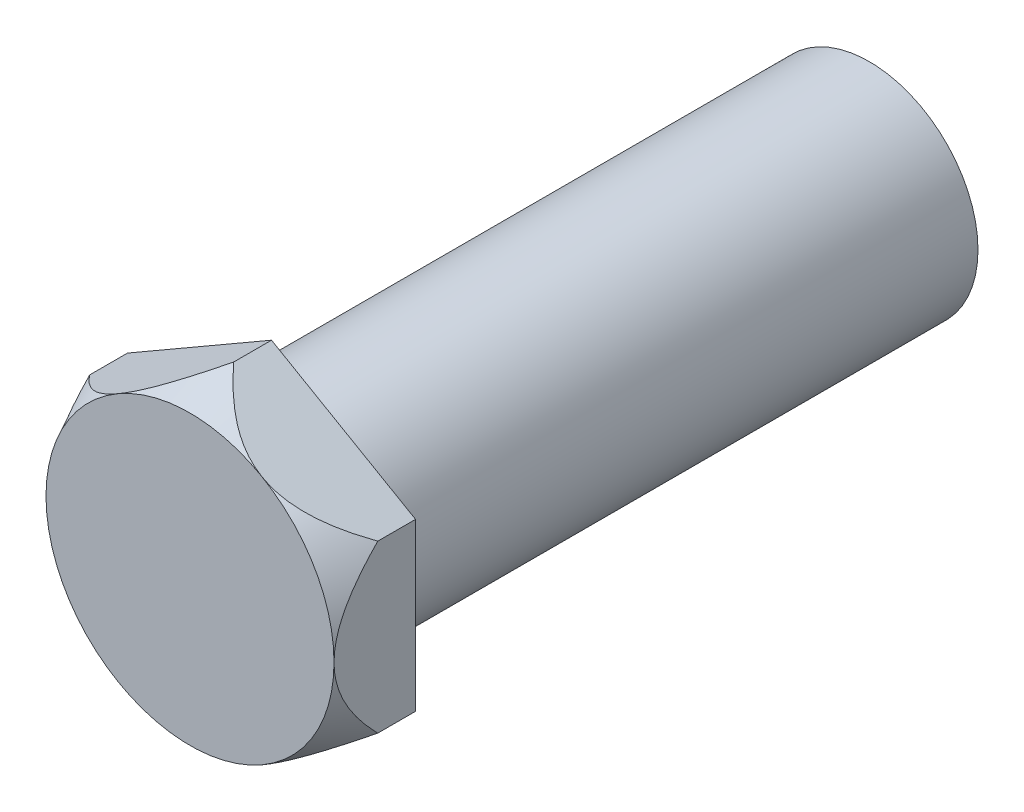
ISO-10303-21;
HEADER;
FILE_DESCRIPTION(('STEP AP214'),'2;1');
FILE_NAME('part.step','',(''),(''),'','','');
FILE_SCHEMA(('AUTOMOTIVE_DESIGN { 1 0 10303 214 1 1 1 1 }'));
ENDSEC;
DATA;
#1=APPLICATION_CONTEXT('core data for automotive mechanical design processes');
#2=APPLICATION_PROTOCOL_DEFINITION('international standard','automotive_design',2000,#1);
#3=PRODUCT_CONTEXT('',#1,'mechanical');
#4=PRODUCT('Part','Part','',(#3));
#5=PRODUCT_RELATED_PRODUCT_CATEGORY('part','',(#4));
#6=PRODUCT_DEFINITION_FORMATION('','',#4);
#7=PRODUCT_DEFINITION_CONTEXT('part definition',#1,'design');
#8=PRODUCT_DEFINITION('design','',#6,#7);
#9=PRODUCT_DEFINITION_SHAPE('','',#8);
#10=(LENGTH_UNIT() NAMED_UNIT(*) SI_UNIT(.MILLI.,.METRE.));
#11=(NAMED_UNIT(*) PLANE_ANGLE_UNIT() SI_UNIT($,.RADIAN.));
#12=(NAMED_UNIT(*) SI_UNIT($,.STERADIAN.) SOLID_ANGLE_UNIT());
#13=UNCERTAINTY_MEASURE_WITH_UNIT(LENGTH_MEASURE(1.E-05),#10,'distance_accuracy_value','');
#14=(GEOMETRIC_REPRESENTATION_CONTEXT(3) GLOBAL_UNCERTAINTY_ASSIGNED_CONTEXT((#13)) GLOBAL_UNIT_ASSIGNED_CONTEXT((#10,
#11,#12)) REPRESENTATION_CONTEXT('',''));
#15=CARTESIAN_POINT('',(0.,0.,0.));
#16=DIRECTION('',(0.,0.,1.));
#17=DIRECTION('',(1.,0.,0.));
#18=AXIS2_PLACEMENT_3D('',#15,#16,#17);
#19=CARTESIAN_POINT('',(0.,3.05995642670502,0.));
#20=DIRECTION('',(0.,0.,1.));
#21=DIRECTION('',(1.,0.,0.));
#22=AXIS2_PLACEMENT_3D('',#19,#20,#21);
#23=PLANE('',#22);
#24=DIRECTION('',(-0.866025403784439,0.5,0.));
#25=VECTOR('',#24,1.);
#26=CARTESIAN_POINT('',(2.65,1.52997821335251,0.));
#27=LINE('',#26,#25);
#28=CARTESIAN_POINT('',(2.65,1.52997821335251,0.));
#29=VERTEX_POINT('',#28);
#30=CARTESIAN_POINT('',(0.,3.05995642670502,0.));
#31=VERTEX_POINT('',#30);
#32=EDGE_CURVE('E113',#29,#31,#27,.T.);
#33=ORIENTED_EDGE('',*,*,#32,.F.);
#34=DIRECTION('',(0.,1.,0.));
#35=VECTOR('',#34,1.);
#36=CARTESIAN_POINT('',(2.65,-1.52997821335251,0.));
#37=LINE('',#36,#35);
#38=CARTESIAN_POINT('',(2.65,-1.52997821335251,0.));
#39=VERTEX_POINT('',#38);
#40=EDGE_CURVE('E260',#39,#29,#37,.T.);
#41=ORIENTED_EDGE('',*,*,#40,.F.);
#42=DIRECTION('',(0.866025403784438,0.5,0.));
#43=VECTOR('',#42,1.);
#44=CARTESIAN_POINT('',(0.,-3.05995642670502,0.));
#45=LINE('',#44,#43);
#46=CARTESIAN_POINT('',(0.,-3.05995642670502,0.));
#47=VERTEX_POINT('',#46);
#48=EDGE_CURVE('E258',#47,#39,#45,.T.);
#49=ORIENTED_EDGE('',*,*,#48,.F.);
#50=DIRECTION('',(0.866025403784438,-0.5,0.));
#51=VECTOR('',#50,1.);
#52=CARTESIAN_POINT('',(-2.65,-1.52997821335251,0.));
#53=LINE('',#52,#51);
#54=CARTESIAN_POINT('',(-2.65,-1.52997821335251,0.));
#55=VERTEX_POINT('',#54);
#56=EDGE_CURVE('E223',#55,#47,#53,.T.);
#57=ORIENTED_EDGE('',*,*,#56,.F.);
#58=DIRECTION('',(0.,-1.,0.));
#59=VECTOR('',#58,1.);
#60=CARTESIAN_POINT('',(-2.65,1.52997821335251,0.));
#61=LINE('',#60,#59);
#62=CARTESIAN_POINT('',(-2.65,1.52997821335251,0.));
#63=VERTEX_POINT('',#62);
#64=EDGE_CURVE('E266',#63,#55,#61,.T.);
#65=ORIENTED_EDGE('',*,*,#64,.F.);
#66=DIRECTION('',(-0.866025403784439,-0.5,0.));
#67=VECTOR('',#66,1.);
#68=CARTESIAN_POINT('',(0.,3.05995642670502,0.));
#69=LINE('',#68,#67);
#70=EDGE_CURVE('E267',#31,#63,#69,.T.);
#71=ORIENTED_EDGE('',*,*,#70,.F.);
#72=EDGE_LOOP('',(#33,#41,#49,#57,#65,#71));
#73=FACE_BOUND('',#72,.T.);
#74=CARTESIAN_POINT('',(0.,0.,0.));
#75=DIRECTION('',(0.,0.,1.));
#76=DIRECTION('',(1.,0.,0.));
#77=AXIS2_PLACEMENT_3D('',#74,#75,#76);
#78=CIRCLE('',#77,2.);
#79=CARTESIAN_POINT('',(2.,0.,0.));
#80=VERTEX_POINT('',#79);
#81=EDGE_CURVE('E12',#80,#80,#78,.F.);
#82=ORIENTED_EDGE('',*,*,#81,.F.);
#83=EDGE_LOOP('',(#82));
#84=FACE_BOUND('',#83,.T.);
#85=ADVANCED_FACE('F31',(#73,#84),#23,.F.);
#86=CARTESIAN_POINT('',(2.65,1.52997821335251,1.5));
#87=DIRECTION('',(-0.5,-0.866025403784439,0.));
#88=DIRECTION('',(0.866025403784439,-0.5,0.));
#89=AXIS2_PLACEMENT_3D('',#86,#87,#88);
#90=PLANE('',#89);
#91=CARTESIAN_POINT('',(2.6502,1.52986274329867,0.695188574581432));
#92=CARTESIAN_POINT('',(2.59634226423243,1.56095752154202,0.756134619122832));
#93=CARTESIAN_POINT('',(2.54130236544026,1.59273482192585,0.815799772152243));
#94=CARTESIAN_POINT('',(2.42795740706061,1.65817456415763,0.931706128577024));
#95=CARTESIAN_POINT('',(2.36963348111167,1.69184789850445,0.987922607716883));
#96=CARTESIAN_POINT('',(2.24764059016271,1.76228052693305,1.09691137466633));
#97=CARTESIAN_POINT('',(2.18386192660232,1.7991031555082,1.14952266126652));
#98=CARTESIAN_POINT('',(2.05217024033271,1.87513538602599,1.24698491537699));
#99=CARTESIAN_POINT('',(1.98426934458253,1.91433798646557,1.29185728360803));
#100=CARTESIAN_POINT('',(1.84748646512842,1.99330961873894,1.36891316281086));
#101=CARTESIAN_POINT('',(1.77883697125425,2.03294442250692,1.40163302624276));
#102=CARTESIAN_POINT('',(1.63838937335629,2.11403188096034,1.45405204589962));
#103=CARTESIAN_POINT('',(1.5666210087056,2.15546736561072,1.47385373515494));
#104=CARTESIAN_POINT('',(1.42019151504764,2.24000847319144,1.49817840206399));
#105=CARTESIAN_POINT('',(1.34550592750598,2.2831282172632,1.50251410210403));
#106=CARTESIAN_POINT('',(1.19674334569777,2.36901633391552,1.49462009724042));
#107=CARTESIAN_POINT('',(1.12266717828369,2.41178422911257,1.48237073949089));
#108=CARTESIAN_POINT('',(0.96618202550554,2.50213097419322,1.44021347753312));
#109=CARTESIAN_POINT('',(0.884289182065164,2.54941182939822,1.40783651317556));
#110=CARTESIAN_POINT('',(0.725557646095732,2.64105552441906,1.32841507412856));
#111=CARTESIAN_POINT('',(0.648760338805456,2.68539447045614,1.28126496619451));
#112=CARTESIAN_POINT('',(0.521460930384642,2.75889081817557,1.19160890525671));
#113=CARTESIAN_POINT('',(0.469637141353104,2.78881129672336,1.15152520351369));
#114=CARTESIAN_POINT('',(0.368447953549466,2.84723290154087,1.0673253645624));
#115=CARTESIAN_POINT('',(0.319084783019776,2.87573274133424,1.02320567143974));
#116=CARTESIAN_POINT('',(0.22368434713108,2.93081220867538,0.932965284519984));
#117=CARTESIAN_POINT('',(0.177596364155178,2.95742111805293,0.886915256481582));
#118=CARTESIAN_POINT('',(0.0873512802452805,3.00952414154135,0.792592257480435));
#119=CARTESIAN_POINT('',(0.0431898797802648,3.03502073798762,0.744324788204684));
#120=CARTESIAN_POINT('',(-0.000199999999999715,3.06007189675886,0.695188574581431));
#121=B_SPLINE_CURVE_WITH_KNOTS('',3,(#91,#92,#93,#94,#95,#96,#97,#98,#99,#100,#101,#102,#103,
#104,#105,#106,#107,#108,#109,#110,#111,#112,#113,#114,#115,#116,#117,#118,#119,#120),
.UNSPECIFIED.,.F.,.F.,(4,2,2,2,2,2,2,2,2,2,2,2,2,2,4),(0.,0.261321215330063,0.524337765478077,
0.795515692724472,1.06593125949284,1.32235701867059,1.57672190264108,1.83415662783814,
2.09189667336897,2.39007583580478,2.69043770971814,2.90633965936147,3.12243369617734,
3.3334879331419,3.54404416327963),.UNSPECIFIED.);
#122=CARTESIAN_POINT('',(2.65,1.52997821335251,0.695415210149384));
#123=VERTEX_POINT('',#122);
#124=CARTESIAN_POINT('',(1.325,2.29496732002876,1.5));
#125=VERTEX_POINT('',#124);
#126=EDGE_CURVE('E106',#123,#125,#121,.T.);
#127=ORIENTED_EDGE('',*,*,#126,.F.);
#128=DIRECTION('',(0.,0.,-1.));
#129=VECTOR('',#128,1.);
#130=CARTESIAN_POINT('',(2.65,1.52997821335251,1.5));
#131=LINE('',#130,#129);
#132=EDGE_CURVE('E55',#123,#29,#131,.T.);
#133=ORIENTED_EDGE('',*,*,#132,.T.);
#134=ORIENTED_EDGE('',*,*,#32,.T.);
#135=DIRECTION('',(0.,0.,-1.));
#136=VECTOR('',#135,1.);
#137=CARTESIAN_POINT('',(0.,3.05995642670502,1.5));
#138=LINE('',#137,#136);
#139=CARTESIAN_POINT('',(0.,3.05995642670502,0.695415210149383));
#140=VERTEX_POINT('',#139);
#141=EDGE_CURVE('E129',#140,#31,#138,.T.);
#142=ORIENTED_EDGE('',*,*,#141,.F.);
#143=EDGE_CURVE('E114',#125,#140,#121,.T.);
#144=ORIENTED_EDGE('',*,*,#143,.F.);
#145=EDGE_LOOP('',(#127,#133,#134,#142,#144));
#146=FACE_BOUND('',#145,.T.);
#147=ADVANCED_FACE('F33',(#146),#90,.F.);
#148=CARTESIAN_POINT('',(0.,3.05995642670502,1.5));
#149=DIRECTION('',(0.5,-0.866025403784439,0.));
#150=DIRECTION('',(0.866025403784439,0.5,0.));
#151=AXIS2_PLACEMENT_3D('',#148,#149,#150);
#152=PLANE('',#151);
#153=CARTESIAN_POINT('',(0.000200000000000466,3.06007189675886,0.695188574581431));
#154=CARTESIAN_POINT('',(-0.0536577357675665,3.02897711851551,0.756134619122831));
#155=CARTESIAN_POINT('',(-0.108697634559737,2.99719981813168,0.815799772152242));
#156=CARTESIAN_POINT('',(-0.222042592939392,2.9317600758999,0.931706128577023));
#157=CARTESIAN_POINT('',(-0.280366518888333,2.89808674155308,0.987922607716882));
#158=CARTESIAN_POINT('',(-0.402359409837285,2.82765411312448,1.09691137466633));
#159=CARTESIAN_POINT('',(-0.466138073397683,2.79083148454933,1.14952266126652));
#160=CARTESIAN_POINT('',(-0.597829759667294,2.71479925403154,1.24698491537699));
#161=CARTESIAN_POINT('',(-0.665730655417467,2.67559665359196,1.29185728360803));
#162=CARTESIAN_POINT('',(-0.802513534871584,2.59662502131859,1.36891316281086));
#163=CARTESIAN_POINT('',(-0.871163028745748,2.55699021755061,1.40163302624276));
#164=CARTESIAN_POINT('',(-1.01161062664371,2.47590275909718,1.45405204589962));
#165=CARTESIAN_POINT('',(-1.0833789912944,2.43446727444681,1.47385373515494));
#166=CARTESIAN_POINT('',(-1.22980848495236,2.34992616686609,1.49817840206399));
#167=CARTESIAN_POINT('',(-1.30449407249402,2.30680642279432,1.50251410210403));
#168=CARTESIAN_POINT('',(-1.45325665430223,2.22091830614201,1.49462009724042));
#169=CARTESIAN_POINT('',(-1.52733282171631,2.17815041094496,1.48237073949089));
#170=CARTESIAN_POINT('',(-1.68381797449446,2.08780366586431,1.44021347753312));
#171=CARTESIAN_POINT('',(-1.76571081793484,2.04052281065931,1.40783651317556));
#172=CARTESIAN_POINT('',(-1.92444235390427,1.94887911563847,1.32841507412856));
#173=CARTESIAN_POINT('',(-2.00123966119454,1.90454016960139,1.28126496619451));
#174=CARTESIAN_POINT('',(-2.12853906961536,1.83104382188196,1.19160890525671));
#175=CARTESIAN_POINT('',(-2.1803628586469,1.80112334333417,1.15152520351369));
#176=CARTESIAN_POINT('',(-2.28155204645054,1.74270173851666,1.0673253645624));
#177=CARTESIAN_POINT('',(-2.33091521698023,1.71420189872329,1.02320567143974));
#178=CARTESIAN_POINT('',(-2.42631565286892,1.65912243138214,0.932965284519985));
#179=CARTESIAN_POINT('',(-2.47240363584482,1.6325135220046,0.886915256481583));
#180=CARTESIAN_POINT('',(-2.56264871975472,1.58041049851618,0.792592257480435));
#181=CARTESIAN_POINT('',(-2.60681012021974,1.55491390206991,0.744324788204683));
#182=CARTESIAN_POINT('',(-2.6502,1.52986274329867,0.695188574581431));
#183=B_SPLINE_CURVE_WITH_KNOTS('',3,(#153,#154,#155,#156,#157,#158,#159,#160,#161,#162,#163,
#164,#165,#166,#167,#168,#169,#170,#171,#172,#173,#174,#175,#176,#177,#178,#179,#180,#181,#182),
.UNSPECIFIED.,.F.,.F.,(4,2,2,2,2,2,2,2,2,2,2,2,2,2,4),(0.,0.261321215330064,0.524337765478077,
0.795515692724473,1.06593125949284,1.3223570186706,1.57672190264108,1.83415662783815,
2.09189667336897,2.39007583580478,2.69043770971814,2.90633965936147,3.12243369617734,
3.33348793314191,3.54404416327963),.UNSPECIFIED.);
#184=CARTESIAN_POINT('',(-1.325,2.29496732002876,1.5));
#185=VERTEX_POINT('',#184);
#186=EDGE_CURVE('E120',#140,#185,#183,.T.);
#187=ORIENTED_EDGE('',*,*,#186,.F.);
#188=ORIENTED_EDGE('',*,*,#141,.T.);
#189=ORIENTED_EDGE('',*,*,#70,.T.);
#190=DIRECTION('',(0.,0.,-1.));
#191=VECTOR('',#190,1.);
#192=CARTESIAN_POINT('',(-2.65,1.52997821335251,1.5));
#193=LINE('',#192,#191);
#194=CARTESIAN_POINT('',(-2.65,1.52997821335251,0.695415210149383));
#195=VERTEX_POINT('',#194);
#196=EDGE_CURVE('E228',#195,#63,#193,.T.);
#197=ORIENTED_EDGE('',*,*,#196,.F.);
#198=EDGE_CURVE('E130',#185,#195,#183,.T.);
#199=ORIENTED_EDGE('',*,*,#198,.F.);
#200=EDGE_LOOP('',(#187,#188,#189,#197,#199));
#201=FACE_BOUND('',#200,.T.);
#202=ADVANCED_FACE('F183',(#201),#152,.F.);
#203=CARTESIAN_POINT('',(-2.65,1.52997821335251,1.5));
#204=DIRECTION('',(1.,0.,0.));
#205=DIRECTION('',(0.,1.,0.));
#206=AXIS2_PLACEMENT_3D('',#203,#204,#205);
#207=PLANE('',#206);
#208=CARTESIAN_POINT('',(-2.65,-3.5626135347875,-2.01331927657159));
#209=CARTESIAN_POINT('',(-2.65,-3.48952785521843,-1.89825176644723));
#210=CARTESIAN_POINT('',(-2.65,-3.41588952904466,-1.78353089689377));
#211=CARTESIAN_POINT('',(-2.65,-3.26724824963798,-1.55494525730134));
#212=CARTESIAN_POINT('',(-2.65,-3.1922450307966,-1.44108066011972));
#213=CARTESIAN_POINT('',(-2.65,-3.03998445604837,-1.21343090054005));
#214=CARTESIAN_POINT('',(-2.65,-2.96271317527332,-1.0996550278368));
#215=CARTESIAN_POINT('',(-2.65,-2.80621453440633,-0.873471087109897));
#216=CARTESIAN_POINT('',(-2.65,-2.72698737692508,-0.761062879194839));
#217=CARTESIAN_POINT('',(-2.65,-2.55597473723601,-0.523885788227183));
#218=CARTESIAN_POINT('',(-2.65,-2.4638667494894,-0.3993484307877));
#219=CARTESIAN_POINT('',(-2.65,-2.27576187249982,-0.153249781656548));
#220=CARTESIAN_POINT('',(-2.65,-2.17976547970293,-0.0316881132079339));
#221=CARTESIAN_POINT('',(-2.65,-1.98303182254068,0.206798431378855));
#222=CARTESIAN_POINT('',(-2.65,-1.88231364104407,0.323738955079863));
#223=CARTESIAN_POINT('',(-2.65,-1.67414252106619,0.551416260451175));
#224=CARTESIAN_POINT('',(-2.65,-1.56669544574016,0.662158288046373));
#225=CARTESIAN_POINT('',(-2.65,-1.3900948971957,0.828907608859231));
#226=CARTESIAN_POINT('',(-2.65,-1.32405047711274,0.888192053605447));
#227=CARTESIAN_POINT('',(-2.65,-1.18817649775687,1.00242114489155));
#228=CARTESIAN_POINT('',(-2.65,-1.11834399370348,1.05736233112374));
#229=CARTESIAN_POINT('',(-2.65,-0.975484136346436,1.16032855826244));
#230=CARTESIAN_POINT('',(-2.65,-0.902530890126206,1.20845494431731));
#231=CARTESIAN_POINT('',(-2.65,-0.751906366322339,1.29653266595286));
#232=CARTESIAN_POINT('',(-2.65,-0.674243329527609,1.33649777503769));
#233=CARTESIAN_POINT('',(-2.65,-0.517572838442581,1.40375331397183));
#234=CARTESIAN_POINT('',(-2.65,-0.438779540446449,1.43152921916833));
#235=CARTESIAN_POINT('',(-2.65,-0.27766742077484,1.47386323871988));
#236=CARTESIAN_POINT('',(-2.65,-0.195351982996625,1.4884337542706));
#237=CARTESIAN_POINT('',(-2.65,-0.0288866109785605,1.5022604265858));
#238=CARTESIAN_POINT('',(-2.65,0.0552713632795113,1.50142423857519));
#239=CARTESIAN_POINT('',(-2.65,0.222003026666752,1.48435081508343));
#240=CARTESIAN_POINT('',(-2.65,0.304575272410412,1.4681001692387));
#241=CARTESIAN_POINT('',(-2.65,0.487379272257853,1.41649928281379));
#242=CARTESIAN_POINT('',(-2.65,0.586471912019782,1.37722074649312));
#243=CARTESIAN_POINT('',(-2.65,0.777442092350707,1.28386946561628));
#244=CARTESIAN_POINT('',(-2.65,0.869295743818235,1.22975017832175));
#245=CARTESIAN_POINT('',(-2.65,1.07102812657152,1.09518673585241));
#246=CARTESIAN_POINT('',(-2.65,1.1787738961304,1.01161204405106));
#247=CARTESIAN_POINT('',(-2.65,1.38589297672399,0.834544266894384));
#248=CARTESIAN_POINT('',(-2.65,1.48524793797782,0.741030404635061));
#249=CARTESIAN_POINT('',(-2.65,1.6787754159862,0.546387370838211));
#250=CARTESIAN_POINT('',(-2.65,1.77286249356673,0.445174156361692));
#251=CARTESIAN_POINT('',(-2.65,1.91015995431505,0.29010943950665));
#252=CARTESIAN_POINT('',(-2.65,1.95526522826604,0.237907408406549));
#253=CARTESIAN_POINT('',(-2.65,2.04436879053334,0.132568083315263));
#254=CARTESIAN_POINT('',(-2.65,2.08836711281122,0.0794308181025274));
#255=CARTESIAN_POINT('',(-2.65,2.22685401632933,-0.0909298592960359));
#256=CARTESIAN_POINT('',(-2.65,2.31952346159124,-0.209632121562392));
#257=CARTESIAN_POINT('',(-2.65,2.50132385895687,-0.449724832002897));
#258=CARTESIAN_POINT('',(-2.65,2.59045421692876,-0.571115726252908));
#259=CARTESIAN_POINT('',(-2.65,2.76596034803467,-0.815963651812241));
#260=CARTESIAN_POINT('',(-2.65,2.852334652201,-0.939421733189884));
#261=CARTESIAN_POINT('',(-2.65,3.02283031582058,-1.18788669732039));
#262=CARTESIAN_POINT('',(-2.65,3.10695157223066,-1.31289365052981));
#263=CARTESIAN_POINT('',(-2.65,3.35705231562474,-1.69044236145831));
#264=CARTESIAN_POINT('',(-2.65,3.52027365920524,-1.94480978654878));
#265=CARTESIAN_POINT('',(-2.65,3.84158994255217,-2.45662656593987));
#266=CARTESIAN_POINT('',(-2.65,3.99968645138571,-2.71407494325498));
#267=CARTESIAN_POINT('',(-2.65,4.2948081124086,-3.20245345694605));
#268=CARTESIAN_POINT('',(-2.65,4.43222167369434,-3.43314941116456));
#269=CARTESIAN_POINT('',(-2.65,4.70479573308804,-3.89589484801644));
#270=CARTESIAN_POINT('',(-2.65,4.83995602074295,-4.12794445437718));
#271=CARTESIAN_POINT('',(-2.65,5.10773302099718,-4.5917672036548));
#272=CARTESIAN_POINT('',(-2.65,5.24035976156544,-4.82353456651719));
#273=CARTESIAN_POINT('',(-2.65,5.50415166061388,-5.28786064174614));
#274=CARTESIAN_POINT('',(-2.65,5.63531700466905,-5.52041924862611));
#275=CARTESIAN_POINT('',(-2.65,5.76592217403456,-5.75328923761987));
#276=B_SPLINE_CURVE_WITH_KNOTS('',3,(#208,#209,#210,#211,#212,#213,#214,#215,#216,#217,#218,
#219,#220,#221,#222,#223,#224,#225,#226,#227,#228,#229,#230,#231,#232,#233,#234,#235,#236,#237,
#238,#239,#240,#241,#242,#243,#244,#245,#246,#247,#248,#249,#250,#251,#252,#253,#254,#255,#256,
#257,#258,#259,#260,#261,#262,#263,#264,#265,#266,#267,#268,#269,#270,#271,#272,#273,#274,#275),
.UNSPECIFIED.,.F.,.F.,(4,2,2,2,2,2,2,2,2,2,2,2,2,2,2,2,2,2,2,2,2,2,2,2,2,2,2,2,2,2,2,2,2,4),(0.,
0.408951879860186,0.817984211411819,1.23057119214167,1.64311561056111,2.10775352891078,
2.57233231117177,3.0351727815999,3.49761542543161,3.76372760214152,4.03004969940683,
4.29186284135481,4.55323041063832,4.80295011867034,5.05243507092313,5.30341587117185,
5.55461522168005,5.87257677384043,6.19154713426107,6.59962509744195,7.008573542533,
7.42290539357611,7.62986359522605,7.83681543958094,8.2884906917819,8.74024145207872,
9.19222910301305,9.64423739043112,10.5508303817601,11.457143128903,12.2626872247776,
13.0683061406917,13.869395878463,14.6703827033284),.UNSPECIFIED.);
#277=CARTESIAN_POINT('',(-2.65,0.,1.5));
#278=VERTEX_POINT('',#277);
#279=EDGE_CURVE('E177',#195,#278,#276,.F.);
#280=ORIENTED_EDGE('',*,*,#279,.F.);
#281=ORIENTED_EDGE('',*,*,#196,.T.);
#282=ORIENTED_EDGE('',*,*,#64,.T.);
#283=DIRECTION('',(0.,0.,-1.));
#284=VECTOR('',#283,1.);
#285=CARTESIAN_POINT('',(-2.65,-1.52997821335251,1.5));
#286=LINE('',#285,#284);
#287=CARTESIAN_POINT('',(-2.65,-1.52997821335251,0.695415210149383));
#288=VERTEX_POINT('',#287);
#289=EDGE_CURVE('E225',#288,#55,#286,.T.);
#290=ORIENTED_EDGE('',*,*,#289,.F.);
#291=EDGE_CURVE('E172',#278,#288,#276,.F.);
#292=ORIENTED_EDGE('',*,*,#291,.F.);
#293=EDGE_LOOP('',(#280,#281,#282,#290,#292));
#294=FACE_BOUND('',#293,.T.);
#295=ADVANCED_FACE('F179',(#294),#207,.F.);
#296=CARTESIAN_POINT('',(-2.65,-1.52997821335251,1.5));
#297=DIRECTION('',(0.5,0.866025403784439,0.));
#298=DIRECTION('',(-0.866025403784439,0.5,0.));
#299=AXIS2_PLACEMENT_3D('',#296,#297,#298);
#300=PLANE('',#299);
#301=CARTESIAN_POINT('',(-2.6502,-1.52986274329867,0.695188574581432));
#302=CARTESIAN_POINT('',(-2.59634226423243,-1.56095752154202,0.756134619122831));
#303=CARTESIAN_POINT('',(-2.54130236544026,-1.59273482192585,0.815799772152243));
#304=CARTESIAN_POINT('',(-2.42795740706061,-1.65817456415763,0.931706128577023));
#305=CARTESIAN_POINT('',(-2.36963348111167,-1.69184789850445,0.987922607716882));
#306=CARTESIAN_POINT('',(-2.24764059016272,-1.76228052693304,1.09691137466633));
#307=CARTESIAN_POINT('',(-2.18386192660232,-1.79910315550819,1.14952266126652));
#308=CARTESIAN_POINT('',(-2.05217024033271,-1.87513538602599,1.24698491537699));
#309=CARTESIAN_POINT('',(-1.98426934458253,-1.91433798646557,1.29185728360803));
#310=CARTESIAN_POINT('',(-1.84748646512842,-1.99330961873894,1.36891316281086));
#311=CARTESIAN_POINT('',(-1.77883697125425,-2.03294442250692,1.40163302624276));
#312=CARTESIAN_POINT('',(-1.63838937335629,-2.11403188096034,1.45405204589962));
#313=CARTESIAN_POINT('',(-1.5666210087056,-2.15546736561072,1.47385373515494));
#314=CARTESIAN_POINT('',(-1.42019151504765,-2.24000847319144,1.49817840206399));
#315=CARTESIAN_POINT('',(-1.34550592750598,-2.2831282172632,1.50251410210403));
#316=CARTESIAN_POINT('',(-1.19674334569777,-2.36901633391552,1.49462009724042));
#317=CARTESIAN_POINT('',(-1.12266717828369,-2.41178422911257,1.48237073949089));
#318=CARTESIAN_POINT('',(-0.96618202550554,-2.50213097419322,1.44021347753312));
#319=CARTESIAN_POINT('',(-0.884289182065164,-2.54941182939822,1.40783651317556));
#320=CARTESIAN_POINT('',(-0.725557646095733,-2.64105552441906,1.32841507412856));
#321=CARTESIAN_POINT('',(-0.648760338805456,-2.68539447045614,1.28126496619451));
#322=CARTESIAN_POINT('',(-0.521460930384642,-2.75889081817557,1.19160890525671));
#323=CARTESIAN_POINT('',(-0.469637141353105,-2.78881129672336,1.15152520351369));
#324=CARTESIAN_POINT('',(-0.368447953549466,-2.84723290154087,1.0673253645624));
#325=CARTESIAN_POINT('',(-0.319084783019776,-2.87573274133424,1.02320567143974));
#326=CARTESIAN_POINT('',(-0.223684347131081,-2.93081220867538,0.932965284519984));
#327=CARTESIAN_POINT('',(-0.177596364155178,-2.95742111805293,0.886915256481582));
#328=CARTESIAN_POINT('',(-0.0873512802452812,-3.00952414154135,0.792592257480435));
#329=CARTESIAN_POINT('',(-0.0431898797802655,-3.03502073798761,0.744324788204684));
#330=CARTESIAN_POINT('',(0.000199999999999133,-3.06007189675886,0.695188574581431));
#331=B_SPLINE_CURVE_WITH_KNOTS('',3,(#301,#302,#303,#304,#305,#306,#307,#308,#309,#310,#311,
#312,#313,#314,#315,#316,#317,#318,#319,#320,#321,#322,#323,#324,#325,#326,#327,#328,#329,#330),
.UNSPECIFIED.,.F.,.F.,(4,2,2,2,2,2,2,2,2,2,2,2,2,2,4),(0.,0.261321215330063,0.524337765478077,
0.795515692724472,1.06593125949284,1.3223570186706,1.57672190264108,1.83415662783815,
2.09189667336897,2.39007583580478,2.69043770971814,2.90633965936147,3.12243369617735,
3.33348793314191,3.54404416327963),.UNSPECIFIED.);
#332=CARTESIAN_POINT('',(-1.325,-2.29496732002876,1.5));
#333=VERTEX_POINT('',#332);
#334=EDGE_CURVE('E178',#288,#333,#331,.T.);
#335=ORIENTED_EDGE('',*,*,#334,.F.);
#336=ORIENTED_EDGE('',*,*,#289,.T.);
#337=ORIENTED_EDGE('',*,*,#56,.T.);
#338=DIRECTION('',(0.,0.,-1.));
#339=VECTOR('',#338,1.);
#340=CARTESIAN_POINT('',(0.,-3.05995642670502,1.5));
#341=LINE('',#340,#339);
#342=CARTESIAN_POINT('',(0.,-3.05995642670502,0.695415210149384));
#343=VERTEX_POINT('',#342);
#344=EDGE_CURVE('E215',#343,#47,#341,.T.);
#345=ORIENTED_EDGE('',*,*,#344,.F.);
#346=EDGE_CURVE('E167',#333,#343,#331,.T.);
#347=ORIENTED_EDGE('',*,*,#346,.F.);
#348=EDGE_LOOP('',(#335,#336,#337,#345,#347));
#349=FACE_BOUND('',#348,.T.);
#350=ADVANCED_FACE('F182',(#349),#300,.F.);
#351=CARTESIAN_POINT('',(0.,-3.05995642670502,1.5));
#352=DIRECTION('',(-0.5,0.866025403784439,0.));
#353=DIRECTION('',(-0.866025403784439,-0.5,0.));
#354=AXIS2_PLACEMENT_3D('',#351,#352,#353);
#355=PLANE('',#354);
#356=CARTESIAN_POINT('',(-0.000200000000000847,-3.06007189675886,0.695188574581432));
#357=CARTESIAN_POINT('',(0.0536577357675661,-3.02897711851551,0.756134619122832));
#358=CARTESIAN_POINT('',(0.108697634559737,-2.99719981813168,0.815799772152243));
#359=CARTESIAN_POINT('',(0.222042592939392,-2.9317600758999,0.931706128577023));
#360=CARTESIAN_POINT('',(0.280366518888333,-2.89808674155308,0.987922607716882));
#361=CARTESIAN_POINT('',(0.402359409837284,-2.82765411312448,1.09691137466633));
#362=CARTESIAN_POINT('',(0.466138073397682,-2.79083148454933,1.14952266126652));
#363=CARTESIAN_POINT('',(0.597829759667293,-2.71479925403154,1.24698491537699));
#364=CARTESIAN_POINT('',(0.665730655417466,-2.67559665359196,1.29185728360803));
#365=CARTESIAN_POINT('',(0.802513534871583,-2.59662502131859,1.36891316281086));
#366=CARTESIAN_POINT('',(0.871163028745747,-2.55699021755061,1.40163302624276));
#367=CARTESIAN_POINT('',(1.01161062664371,-2.47590275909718,1.45405204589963));
#368=CARTESIAN_POINT('',(1.0833789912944,-2.43446727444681,1.47385373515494));
#369=CARTESIAN_POINT('',(1.22980848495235,-2.34992616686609,1.49817840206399));
#370=CARTESIAN_POINT('',(1.30449407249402,-2.30680642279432,1.50251410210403));
#371=CARTESIAN_POINT('',(1.45325665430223,-2.22091830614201,1.49462009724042));
#372=CARTESIAN_POINT('',(1.52733282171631,-2.17815041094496,1.48237073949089));
#373=CARTESIAN_POINT('',(1.68381797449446,-2.08780366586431,1.44021347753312));
#374=CARTESIAN_POINT('',(1.76571081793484,-2.0405228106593,1.40783651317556));
#375=CARTESIAN_POINT('',(1.92444235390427,-1.94887911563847,1.32841507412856));
#376=CARTESIAN_POINT('',(2.00123966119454,-1.90454016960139,1.28126496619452));
#377=CARTESIAN_POINT('',(2.12853906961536,-1.83104382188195,1.19160890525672));
#378=CARTESIAN_POINT('',(2.1803628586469,-1.80112334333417,1.15152520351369));
#379=CARTESIAN_POINT('',(2.28155204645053,-1.74270173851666,1.06732536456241));
#380=CARTESIAN_POINT('',(2.33091521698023,-1.71420189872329,1.02320567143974));
#381=CARTESIAN_POINT('',(2.42631565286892,-1.65912243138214,0.932965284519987));
#382=CARTESIAN_POINT('',(2.47240363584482,-1.6325135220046,0.886915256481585));
#383=CARTESIAN_POINT('',(2.56264871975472,-1.58041049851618,0.792592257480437));
#384=CARTESIAN_POINT('',(2.60681012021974,-1.55491390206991,0.744324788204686));
#385=CARTESIAN_POINT('',(2.6502,-1.52986274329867,0.695188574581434));
#386=B_SPLINE_CURVE_WITH_KNOTS('',3,(#356,#357,#358,#359,#360,#361,#362,#363,#364,#365,#366,
#367,#368,#369,#370,#371,#372,#373,#374,#375,#376,#377,#378,#379,#380,#381,#382,#383,#384,#385),
.UNSPECIFIED.,.F.,.F.,(4,2,2,2,2,2,2,2,2,2,2,2,2,2,4),(0.,0.261321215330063,0.524337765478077,
0.795515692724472,1.06593125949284,1.3223570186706,1.57672190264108,1.83415662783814,
2.09189667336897,2.39007583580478,2.69043770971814,2.90633965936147,3.12243369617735,
3.33348793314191,3.54404416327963),.UNSPECIFIED.);
#387=CARTESIAN_POINT('',(1.325,-2.29496732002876,1.5));
#388=VERTEX_POINT('',#387);
#389=EDGE_CURVE('E212',#343,#388,#386,.T.);
#390=ORIENTED_EDGE('',*,*,#389,.F.);
#391=ORIENTED_EDGE('',*,*,#344,.T.);
#392=ORIENTED_EDGE('',*,*,#48,.T.);
#393=DIRECTION('',(0.,0.,-1.));
#394=VECTOR('',#393,1.);
#395=CARTESIAN_POINT('',(2.65,-1.52997821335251,1.5));
#396=LINE('',#395,#394);
#397=CARTESIAN_POINT('',(2.65,-1.52997821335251,0.695415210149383));
#398=VERTEX_POINT('',#397);
#399=EDGE_CURVE('E226',#398,#39,#396,.T.);
#400=ORIENTED_EDGE('',*,*,#399,.F.);
#401=EDGE_CURVE('E161',#388,#398,#386,.T.);
#402=ORIENTED_EDGE('',*,*,#401,.F.);
#403=EDGE_LOOP('',(#390,#391,#392,#400,#402));
#404=FACE_BOUND('',#403,.T.);
#405=ADVANCED_FACE('F201',(#404),#355,.F.);
#406=CARTESIAN_POINT('',(2.65,-1.52997821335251,1.5));
#407=DIRECTION('',(-1.,0.,0.));
#408=DIRECTION('',(0.,0.,1.));
#409=AXIS2_PLACEMENT_3D('',#406,#407,#408);
#410=PLANE('',#409);
#411=CARTESIAN_POINT('',(2.65,-3.56261335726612,-2.0133189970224));
#412=CARTESIAN_POINT('',(2.65,-3.48952768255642,-1.89825149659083));
#413=CARTESIAN_POINT('',(2.65,-3.41588936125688,-1.78353063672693));
#414=CARTESIAN_POINT('',(2.65,-3.2672480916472,-1.55494501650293));
#415=CARTESIAN_POINT('',(2.65,-3.1922448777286,-1.44108042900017));
#416=CARTESIAN_POINT('',(2.65,-3.03998431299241,-1.21343068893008));
#417=CARTESIAN_POINT('',(2.65,-2.96271303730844,-1.09965482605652));
#418=CARTESIAN_POINT('',(2.65,-2.80621440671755,-0.873470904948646));
#419=CARTESIAN_POINT('',(2.65,-2.72698725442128,-0.761062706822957));
#420=CARTESIAN_POINT('',(2.65,-2.55597462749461,-0.523885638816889));
#421=CARTESIAN_POINT('',(2.65,-2.46386664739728,-0.399348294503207));
#422=CARTESIAN_POINT('',(2.65,-2.27576178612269,-0.153249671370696));
#423=CARTESIAN_POINT('',(2.65,-2.17976540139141,-0.0316880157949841));
#424=CARTESIAN_POINT('',(2.65,-1.98303176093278,0.206798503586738));
#425=CARTESIAN_POINT('',(2.65,-1.88231358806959,0.323739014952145));
#426=CARTESIAN_POINT('',(2.65,-1.67414248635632,0.551416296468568));
#427=CARTESIAN_POINT('',(2.65,-1.56669542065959,0.662158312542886));
#428=CARTESIAN_POINT('',(2.65,-1.39009488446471,0.828907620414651));
#429=CARTESIAN_POINT('',(2.65,-1.3240504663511,0.888192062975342));
#430=CARTESIAN_POINT('',(2.65,-1.18817649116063,1.00242115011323));
#431=CARTESIAN_POINT('',(2.65,-1.11834398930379,1.05736233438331));
#432=CARTESIAN_POINT('',(2.65,-0.975484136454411,1.16032855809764));
#433=CARTESIAN_POINT('',(2.65,-0.902530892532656,1.20845494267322));
#434=CARTESIAN_POINT('',(2.65,-0.751906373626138,1.29653266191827));
#435=CARTESIAN_POINT('',(2.65,-0.674243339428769,1.33649777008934));
#436=CARTESIAN_POINT('',(2.65,-0.517572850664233,1.40375330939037));
#437=CARTESIAN_POINT('',(2.65,-0.438779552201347,1.43152921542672));
#438=CARTESIAN_POINT('',(2.65,-0.277667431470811,1.4738632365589));
#439=CARTESIAN_POINT('',(2.65,-0.195351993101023,1.48843375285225));
#440=CARTESIAN_POINT('',(2.65,-0.0288866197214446,1.50226042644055));
#441=CARTESIAN_POINT('',(2.65,0.0552713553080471,1.50142423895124));
#442=CARTESIAN_POINT('',(2.65,0.222003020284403,1.48435081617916));
#443=CARTESIAN_POINT('',(2.65,0.304575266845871,1.46810017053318));
#444=CARTESIAN_POINT('',(2.65,0.487379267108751,1.4164992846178));
#445=CARTESIAN_POINT('',(2.65,0.58647190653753,1.37722074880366));
#446=CARTESIAN_POINT('',(2.65,0.777442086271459,1.28386946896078));
#447=CARTESIAN_POINT('',(2.65,0.869295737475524,1.22975018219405));
#448=CARTESIAN_POINT('',(2.65,1.07102811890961,1.09518674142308));
#449=CARTESIAN_POINT('',(2.65,1.17877388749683,1.0116120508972));
#450=CARTESIAN_POINT('',(2.65,1.3858929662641,0.834544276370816));
#451=CARTESIAN_POINT('',(2.65,1.48524792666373,0.741030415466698));
#452=CARTESIAN_POINT('',(2.65,1.67877540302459,0.546387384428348));
#453=CARTESIAN_POINT('',(2.65,1.77286247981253,0.445174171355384));
#454=CARTESIAN_POINT('',(2.65,1.91015993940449,0.290109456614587));
#455=CARTESIAN_POINT('',(2.65,1.95526521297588,0.237907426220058));
#456=CARTESIAN_POINT('',(2.65,2.0443687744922,0.132568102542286));
#457=CARTESIAN_POINT('',(2.65,2.08836709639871,0.0794308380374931));
#458=CARTESIAN_POINT('',(2.65,2.22685399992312,-0.0909298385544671));
#459=CARTESIAN_POINT('',(2.65,2.31952344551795,-0.209632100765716));
#460=CARTESIAN_POINT('',(2.65,2.50132384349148,-0.449724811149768));
#461=CARTESIAN_POINT('',(2.65,2.59045420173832,-0.571115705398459));
#462=CARTESIAN_POINT('',(2.65,2.76596033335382,-0.815963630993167));
#463=CARTESIAN_POINT('',(2.65,2.8523346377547,-0.93942171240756));
#464=CARTESIAN_POINT('',(2.65,3.02283030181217,-1.18788667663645));
#465=CARTESIAN_POINT('',(2.65,3.10695155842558,-1.3128936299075));
#466=CARTESIAN_POINT('',(2.65,3.35705230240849,-1.69044234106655));
#467=CARTESIAN_POINT('',(2.65,3.52027364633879,-1.94480976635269));
#468=CARTESIAN_POINT('',(2.65,3.84158993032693,-2.4566265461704));
#469=CARTESIAN_POINT('',(2.65,3.99968643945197,-2.71407492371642));
#470=CARTESIAN_POINT('',(2.65,4.294808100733,-3.20245343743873));
#471=CARTESIAN_POINT('',(2.65,4.43222166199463,-3.43314939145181));
#472=CARTESIAN_POINT('',(2.65,4.70479572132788,-3.89589482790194));
#473=CARTESIAN_POINT('',(2.65,4.83995600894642,-4.12794443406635));
#474=CARTESIAN_POINT('',(2.65,5.10773300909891,-4.59176718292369));
#475=CARTESIAN_POINT('',(2.65,5.2403597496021,-4.82353454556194));
#476=CARTESIAN_POINT('',(2.65,5.50415164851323,-5.28786062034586));
#477=CARTESIAN_POINT('',(2.65,5.63531699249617,-5.52041922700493));
#478=CARTESIAN_POINT('',(2.65,5.76592216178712,-5.75328921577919));
#479=B_SPLINE_CURVE_WITH_KNOTS('',3,(#411,#412,#413,#414,#415,#416,#417,#418,#419,#420,#421,
#422,#423,#424,#425,#426,#427,#428,#429,#430,#431,#432,#433,#434,#435,#436,#437,#438,#439,#440,
#441,#442,#443,#444,#445,#446,#447,#448,#449,#450,#451,#452,#453,#454,#455,#456,#457,#458,#459,
#460,#461,#462,#463,#464,#465,#466,#467,#468,#469,#470,#471,#472,#473,#474,#475,#476,#477,#478),
.UNSPECIFIED.,.F.,.F.,(4,2,2,2,2,2,2,2,2,2,2,2,2,2,2,2,2,2,2,2,2,2,2,2,2,2,2,2,2,2,2,2,2,4),(0.,
0.408951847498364,0.817984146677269,1.23057109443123,1.64311547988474,2.10775335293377,
2.57233208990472,3.03517251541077,3.49761511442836,3.76372728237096,4.03004937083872,
4.29186250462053,4.55323006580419,4.80294977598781,5.05243473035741,5.30341553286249,
5.55461488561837,5.87257643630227,6.19154679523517,6.59962475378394,7.00857319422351,
7.42290504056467,7.62986323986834,7.83681508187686,8.28849033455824,8.74024109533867,
9.19222874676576,9.6442370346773,10.5508300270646,11.4571427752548,12.2626868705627,
13.0683057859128,13.8693955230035,14.6703823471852),.UNSPECIFIED.);
#480=CARTESIAN_POINT('',(2.65,0.,1.5));
#481=VERTEX_POINT('',#480);
#482=EDGE_CURVE('E257',#398,#481,#479,.T.);
#483=ORIENTED_EDGE('',*,*,#482,.F.);
#484=ORIENTED_EDGE('',*,*,#399,.T.);
#485=ORIENTED_EDGE('',*,*,#40,.T.);
#486=ORIENTED_EDGE('',*,*,#132,.F.);
#487=EDGE_CURVE('E111',#481,#123,#479,.T.);
#488=ORIENTED_EDGE('',*,*,#487,.F.);
#489=EDGE_LOOP('',(#483,#484,#485,#486,#488));
#490=FACE_BOUND('',#489,.T.);
#491=ADVANCED_FACE('F198',(#490),#410,.F.);
#492=CARTESIAN_POINT('',(0.,0.,1.5));
#493=DIRECTION('',(0.,0.,-1.));
#494=DIRECTION('',(1.,0.,0.));
#495=AXIS2_PLACEMENT_3D('',#492,#493,#494);
#496=CONICAL_SURFACE('',#495,2.65,0.471238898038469);
#497=ORIENTED_EDGE('',*,*,#401,.T.);
#498=ORIENTED_EDGE('',*,*,#482,.T.);
#499=CARTESIAN_POINT('',(0.,0.,1.5));
#500=DIRECTION('',(0.,0.,1.));
#501=DIRECTION('',(1.,0.,0.));
#502=AXIS2_PLACEMENT_3D('',#499,#500,#501);
#503=CIRCLE('',#502,2.65);
#504=EDGE_CURVE('E47',#388,#481,#503,.T.);
#505=ORIENTED_EDGE('',*,*,#504,.F.);
#506=EDGE_LOOP('',(#497,#498,#505));
#507=FACE_BOUND('',#506,.T.);
#508=ADVANCED_FACE('F146',(#507),#496,.T.);
#509=ORIENTED_EDGE('',*,*,#346,.T.);
#510=ORIENTED_EDGE('',*,*,#389,.T.);
#511=EDGE_CURVE('E234',#333,#388,#503,.T.);
#512=ORIENTED_EDGE('',*,*,#511,.F.);
#513=EDGE_LOOP('',(#509,#510,#512));
#514=FACE_BOUND('',#513,.T.);
#515=ADVANCED_FACE('F246',(#514),#496,.T.);
#516=ORIENTED_EDGE('',*,*,#291,.T.);
#517=ORIENTED_EDGE('',*,*,#334,.T.);
#518=EDGE_CURVE('E235',#278,#333,#503,.T.);
#519=ORIENTED_EDGE('',*,*,#518,.F.);
#520=EDGE_LOOP('',(#516,#517,#519));
#521=FACE_BOUND('',#520,.T.);
#522=ADVANCED_FACE('F245',(#521),#496,.T.);
#523=ORIENTED_EDGE('',*,*,#198,.T.);
#524=ORIENTED_EDGE('',*,*,#279,.T.);
#525=EDGE_CURVE('E124',#185,#278,#503,.T.);
#526=ORIENTED_EDGE('',*,*,#525,.F.);
#527=EDGE_LOOP('',(#523,#524,#526));
#528=FACE_BOUND('',#527,.T.);
#529=ADVANCED_FACE('F252',(#528),#496,.T.);
#530=ORIENTED_EDGE('',*,*,#143,.T.);
#531=ORIENTED_EDGE('',*,*,#186,.T.);
#532=EDGE_CURVE('E40',#125,#185,#503,.T.);
#533=ORIENTED_EDGE('',*,*,#532,.F.);
#534=EDGE_LOOP('',(#530,#531,#533));
#535=FACE_BOUND('',#534,.T.);
#536=ADVANCED_FACE('F118',(#535),#496,.T.);
#537=ORIENTED_EDGE('',*,*,#126,.T.);
#538=CARTESIAN_POINT('',(0.,0.,1.5));
#539=DIRECTION('',(0.,0.,1.));
#540=DIRECTION('',(1.,0.,0.));
#541=AXIS2_PLACEMENT_3D('',#538,#539,#540);
#542=CIRCLE('',#541,2.65);
#543=EDGE_CURVE('E109',#481,#125,#542,.T.);
#544=ORIENTED_EDGE('',*,*,#543,.F.);
#545=ORIENTED_EDGE('',*,*,#487,.T.);
#546=EDGE_LOOP('',(#537,#544,#545));
#547=FACE_BOUND('',#546,.T.);
#548=ADVANCED_FACE('F108',(#547),#496,.T.);
#549=CARTESIAN_POINT('',(0.,3.05995642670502,1.5));
#550=DIRECTION('',(0.,0.,1.));
#551=DIRECTION('',(1.,0.,0.));
#552=AXIS2_PLACEMENT_3D('',#549,#550,#551);
#553=PLANE('',#552);
#554=ORIENTED_EDGE('',*,*,#504,.T.);
#555=ORIENTED_EDGE('',*,*,#543,.T.);
#556=ORIENTED_EDGE('',*,*,#532,.T.);
#557=ORIENTED_EDGE('',*,*,#525,.T.);
#558=ORIENTED_EDGE('',*,*,#518,.T.);
#559=ORIENTED_EDGE('',*,*,#511,.T.);
#560=EDGE_LOOP('',(#554,#555,#556,#557,#558,#559));
#561=FACE_BOUND('',#560,.T.);
#562=ADVANCED_FACE('F125',(#561),#553,.T.);
#563=CARTESIAN_POINT('',(0.,0.,-11.));
#564=DIRECTION('',(0.,0.,1.));
#565=DIRECTION('',(1.,0.,0.));
#566=AXIS2_PLACEMENT_3D('',#563,#564,#565);
#567=CYLINDRICAL_SURFACE('',#566,2.);
#568=CARTESIAN_POINT('',(0.,0.,-11.));
#569=DIRECTION('',(0.,0.,-1.));
#570=DIRECTION('',(-1.,0.,0.));
#571=AXIS2_PLACEMENT_3D('',#568,#569,#570);
#572=CIRCLE('',#571,2.);
#573=CARTESIAN_POINT('',(-2.,0.,-11.));
#574=VERTEX_POINT('',#573);
#575=EDGE_CURVE('E126',#574,#574,#572,.T.);
#576=ORIENTED_EDGE('',*,*,#575,.F.);
#577=EDGE_LOOP('',(#576));
#578=FACE_BOUND('',#577,.T.);
#579=ORIENTED_EDGE('',*,*,#81,.T.);
#580=EDGE_LOOP('',(#579));
#581=FACE_BOUND('',#580,.T.);
#582=ADVANCED_FACE('F147',(#578,#581),#567,.T.);
#583=CARTESIAN_POINT('',(0.,0.,-11.));
#584=DIRECTION('',(0.,0.,-1.));
#585=DIRECTION('',(-1.,0.,0.));
#586=AXIS2_PLACEMENT_3D('',#583,#584,#585);
#587=PLANE('',#586);
#588=ORIENTED_EDGE('',*,*,#575,.T.);
#589=EDGE_LOOP('',(#588));
#590=FACE_BOUND('',#589,.T.);
#591=ADVANCED_FACE('F291',(#590),#587,.T.);
#592=CLOSED_SHELL('',(#85,#147,#202,#295,#350,#405,#491,#508,#515,#522,#529,#536,#548,#562,#582,#591));
#593=MANIFOLD_SOLID_BREP('B2',#592);
#594=ADVANCED_BREP_SHAPE_REPRESENTATION('',(#18,#593),#14);
#595=SHAPE_DEFINITION_REPRESENTATION(#9,#594);
ENDSEC;
END-ISO-10303-21;
